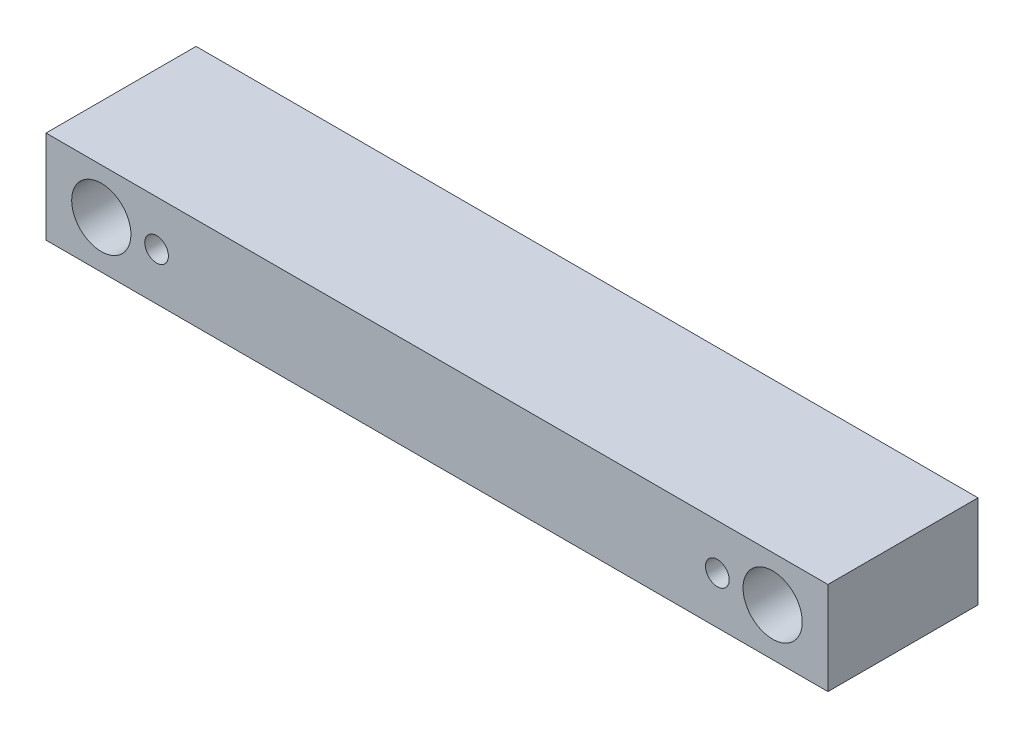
ISO-10303-21;
HEADER;
FILE_DESCRIPTION(('STEP AP214'),'2;1');
FILE_NAME('part.step','',(''),(''),'','','');
FILE_SCHEMA(('AUTOMOTIVE_DESIGN { 1 0 10303 214 1 1 1 1 }'));
ENDSEC;
DATA;
#1=APPLICATION_CONTEXT('core data for automotive mechanical design processes');
#2=APPLICATION_PROTOCOL_DEFINITION('international standard','automotive_design',2000,#1);
#3=PRODUCT_CONTEXT('',#1,'mechanical');
#4=PRODUCT('Part','Part','',(#3));
#5=PRODUCT_RELATED_PRODUCT_CATEGORY('part','',(#4));
#6=PRODUCT_DEFINITION_FORMATION('','',#4);
#7=PRODUCT_DEFINITION_CONTEXT('part definition',#1,'design');
#8=PRODUCT_DEFINITION('design','',#6,#7);
#9=PRODUCT_DEFINITION_SHAPE('','',#8);
#10=(LENGTH_UNIT() NAMED_UNIT(*) SI_UNIT(.MILLI.,.METRE.));
#11=(NAMED_UNIT(*) PLANE_ANGLE_UNIT() SI_UNIT($,.RADIAN.));
#12=(NAMED_UNIT(*) SI_UNIT($,.STERADIAN.) SOLID_ANGLE_UNIT());
#13=UNCERTAINTY_MEASURE_WITH_UNIT(LENGTH_MEASURE(1.E-05),#10,'distance_accuracy_value','');
#14=(GEOMETRIC_REPRESENTATION_CONTEXT(3) GLOBAL_UNCERTAINTY_ASSIGNED_CONTEXT((#13)) GLOBAL_UNIT_ASSIGNED_CONTEXT((#10,
#11,#12)) REPRESENTATION_CONTEXT('',''));
#15=CARTESIAN_POINT('',(0.,0.,0.));
#16=DIRECTION('',(0.,0.,1.));
#17=DIRECTION('',(1.,0.,0.));
#18=AXIS2_PLACEMENT_3D('',#15,#16,#17);
#19=CARTESIAN_POINT('',(-198.,-101.,-168.));
#20=DIRECTION('',(-1.,0.,0.));
#21=DIRECTION('',(0.,0.,1.));
#22=AXIS2_PLACEMENT_3D('',#19,#20,#21);
#23=PLANE('',#22);
#24=DIRECTION('',(0.,-1.,0.));
#25=VECTOR('',#24,1.);
#26=CARTESIAN_POINT('',(-198.,-101.,-92.));
#27=LINE('',#26,#25);
#28=CARTESIAN_POINT('',(-198.,-101.,-92.));
#29=VERTEX_POINT('',#28);
#30=CARTESIAN_POINT('',(-198.,-148.,-92.));
#31=VERTEX_POINT('',#30);
#32=EDGE_CURVE('E166',#29,#31,#27,.T.);
#33=ORIENTED_EDGE('',*,*,#32,.F.);
#34=DIRECTION('',(0.,0.,1.));
#35=VECTOR('',#34,1.);
#36=CARTESIAN_POINT('',(-198.,-101.,-168.));
#37=LINE('',#36,#35);
#38=CARTESIAN_POINT('',(-198.,-101.,-168.));
#39=VERTEX_POINT('',#38);
#40=EDGE_CURVE('E165',#39,#29,#37,.T.);
#41=ORIENTED_EDGE('',*,*,#40,.F.);
#42=DIRECTION('',(0.,-1.,0.));
#43=VECTOR('',#42,1.);
#44=CARTESIAN_POINT('',(-198.,-101.,-168.));
#45=LINE('',#44,#43);
#46=CARTESIAN_POINT('',(-198.,-148.,-168.));
#47=VERTEX_POINT('',#46);
#48=EDGE_CURVE('E150',#39,#47,#45,.T.);
#49=ORIENTED_EDGE('',*,*,#48,.T.);
#50=DIRECTION('',(0.,0.,1.));
#51=VECTOR('',#50,1.);
#52=CARTESIAN_POINT('',(-198.,-148.,-168.));
#53=LINE('',#52,#51);
#54=EDGE_CURVE('E183',#47,#31,#53,.T.);
#55=ORIENTED_EDGE('',*,*,#54,.T.);
#56=EDGE_LOOP('',(#33,#41,#49,#55));
#57=FACE_BOUND('',#56,.T.);
#58=ADVANCED_FACE('F16',(#57),#23,.T.);
#59=CARTESIAN_POINT('',(-198.,-148.,-168.));
#60=DIRECTION('',(0.,-1.,0.));
#61=DIRECTION('',(0.,0.,-1.));
#62=AXIS2_PLACEMENT_3D('',#59,#60,#61);
#63=PLANE('',#62);
#64=DIRECTION('',(1.,0.,0.));
#65=VECTOR('',#64,1.);
#66=CARTESIAN_POINT('',(-198.,-148.,-92.));
#67=LINE('',#66,#65);
#68=CARTESIAN_POINT('',(198.,-148.,-92.));
#69=VERTEX_POINT('',#68);
#70=EDGE_CURVE('E169',#31,#69,#67,.T.);
#71=ORIENTED_EDGE('',*,*,#70,.F.);
#72=ORIENTED_EDGE('',*,*,#54,.F.);
#73=DIRECTION('',(1.,0.,0.));
#74=VECTOR('',#73,1.);
#75=CARTESIAN_POINT('',(-198.,-148.,-168.));
#76=LINE('',#75,#74);
#77=CARTESIAN_POINT('',(198.,-148.,-168.));
#78=VERTEX_POINT('',#77);
#79=EDGE_CURVE('E153',#47,#78,#76,.T.);
#80=ORIENTED_EDGE('',*,*,#79,.T.);
#81=DIRECTION('',(0.,0.,1.));
#82=VECTOR('',#81,1.);
#83=CARTESIAN_POINT('',(198.,-148.,-168.));
#84=LINE('',#83,#82);
#85=EDGE_CURVE('E51',#78,#69,#84,.T.);
#86=ORIENTED_EDGE('',*,*,#85,.T.);
#87=EDGE_LOOP('',(#71,#72,#80,#86));
#88=FACE_BOUND('',#87,.T.);
#89=ADVANCED_FACE('F84',(#88),#63,.T.);
#90=CARTESIAN_POINT('',(198.,-148.,-168.));
#91=DIRECTION('',(1.,0.,0.));
#92=DIRECTION('',(0.,0.,-1.));
#93=AXIS2_PLACEMENT_3D('',#90,#91,#92);
#94=PLANE('',#93);
#95=DIRECTION('',(0.,1.,0.));
#96=VECTOR('',#95,1.);
#97=CARTESIAN_POINT('',(198.,-148.,-92.));
#98=LINE('',#97,#96);
#99=CARTESIAN_POINT('',(198.,-101.,-92.));
#100=VERTEX_POINT('',#99);
#101=EDGE_CURVE('E172',#69,#100,#98,.T.);
#102=ORIENTED_EDGE('',*,*,#101,.F.);
#103=ORIENTED_EDGE('',*,*,#85,.F.);
#104=DIRECTION('',(0.,1.,0.));
#105=VECTOR('',#104,1.);
#106=CARTESIAN_POINT('',(198.,-148.,-168.));
#107=LINE('',#106,#105);
#108=CARTESIAN_POINT('',(198.,-101.,-168.));
#109=VERTEX_POINT('',#108);
#110=EDGE_CURVE('E156',#78,#109,#107,.T.);
#111=ORIENTED_EDGE('',*,*,#110,.T.);
#112=DIRECTION('',(0.,0.,1.));
#113=VECTOR('',#112,1.);
#114=CARTESIAN_POINT('',(198.,-101.,-168.));
#115=LINE('',#114,#113);
#116=EDGE_CURVE('E33',#109,#100,#115,.T.);
#117=ORIENTED_EDGE('',*,*,#116,.T.);
#118=EDGE_LOOP('',(#102,#103,#111,#117));
#119=FACE_BOUND('',#118,.T.);
#120=ADVANCED_FACE('F90',(#119),#94,.T.);
#121=CARTESIAN_POINT('',(-170.,-124.,-168.));
#122=DIRECTION('',(0.,0.,1.));
#123=DIRECTION('',(1.,0.,0.));
#124=AXIS2_PLACEMENT_3D('',#121,#122,#123);
#125=CYLINDRICAL_SURFACE('',#124,15.);
#126=CARTESIAN_POINT('',(-170.,-124.,-168.));
#127=DIRECTION('',(0.,0.,-1.));
#128=DIRECTION('',(0.,1.,0.));
#129=AXIS2_PLACEMENT_3D('',#126,#127,#128);
#130=CIRCLE('',#129,15.);
#131=CARTESIAN_POINT('',(-170.,-109.,-168.));
#132=VERTEX_POINT('',#131);
#133=EDGE_CURVE('E159',#132,#132,#130,.T.);
#134=ORIENTED_EDGE('',*,*,#133,.T.);
#135=EDGE_LOOP('',(#134));
#136=FACE_BOUND('',#135,.T.);
#137=CARTESIAN_POINT('',(-170.,-124.,-92.));
#138=DIRECTION('',(0.,0.,-1.));
#139=DIRECTION('',(0.,1.,0.));
#140=AXIS2_PLACEMENT_3D('',#137,#138,#139);
#141=CIRCLE('',#140,15.);
#142=CARTESIAN_POINT('',(-170.,-109.,-92.));
#143=VERTEX_POINT('',#142);
#144=EDGE_CURVE('E176',#143,#143,#141,.T.);
#145=ORIENTED_EDGE('',*,*,#144,.F.);
#146=EDGE_LOOP('',(#145));
#147=FACE_BOUND('',#146,.T.);
#148=ADVANCED_FACE('F96',(#136,#147),#125,.F.);
#149=CARTESIAN_POINT('',(0.,-101.,-168.));
#150=DIRECTION('',(0.,1.,0.));
#151=DIRECTION('',(-1.,0.,0.));
#152=AXIS2_PLACEMENT_3D('',#149,#150,#151);
#153=PLANE('',#152);
#154=DIRECTION('',(-1.,0.,0.));
#155=VECTOR('',#154,1.);
#156=CARTESIAN_POINT('',(0.,-101.,-92.));
#157=LINE('',#156,#155);
#158=EDGE_CURVE('E55',#100,#29,#157,.T.);
#159=ORIENTED_EDGE('',*,*,#158,.F.);
#160=ORIENTED_EDGE('',*,*,#116,.F.);
#161=DIRECTION('',(-1.,0.,0.));
#162=VECTOR('',#161,1.);
#163=CARTESIAN_POINT('',(198.,-101.,-168.));
#164=LINE('',#163,#162);
#165=EDGE_CURVE('E58',#109,#39,#164,.T.);
#166=ORIENTED_EDGE('',*,*,#165,.T.);
#167=ORIENTED_EDGE('',*,*,#40,.T.);
#168=EDGE_LOOP('',(#159,#160,#166,#167));
#169=FACE_BOUND('',#168,.T.);
#170=ADVANCED_FACE('F98',(#169),#153,.T.);
#171=CARTESIAN_POINT('',(170.,-124.,-168.));
#172=DIRECTION('',(0.,0.,1.));
#173=DIRECTION('',(1.,0.,0.));
#174=AXIS2_PLACEMENT_3D('',#171,#172,#173);
#175=CYLINDRICAL_SURFACE('',#174,15.);
#176=CARTESIAN_POINT('',(170.,-124.,-168.));
#177=DIRECTION('',(0.,0.,-1.));
#178=DIRECTION('',(0.,1.,0.));
#179=AXIS2_PLACEMENT_3D('',#176,#177,#178);
#180=CIRCLE('',#179,15.);
#181=CARTESIAN_POINT('',(170.,-109.,-168.));
#182=VERTEX_POINT('',#181);
#183=EDGE_CURVE('E162',#182,#182,#180,.T.);
#184=ORIENTED_EDGE('',*,*,#183,.T.);
#185=EDGE_LOOP('',(#184));
#186=FACE_BOUND('',#185,.T.);
#187=CARTESIAN_POINT('',(170.,-124.,-92.));
#188=DIRECTION('',(0.,0.,-1.));
#189=DIRECTION('',(0.,1.,0.));
#190=AXIS2_PLACEMENT_3D('',#187,#188,#189);
#191=CIRCLE('',#190,15.);
#192=CARTESIAN_POINT('',(170.,-109.,-92.));
#193=VERTEX_POINT('',#192);
#194=EDGE_CURVE('E154',#193,#193,#191,.T.);
#195=ORIENTED_EDGE('',*,*,#194,.F.);
#196=EDGE_LOOP('',(#195));
#197=FACE_BOUND('',#196,.T.);
#198=ADVANCED_FACE('F101',(#186,#197),#175,.F.);
#199=CARTESIAN_POINT('',(-170.,-124.,-168.));
#200=DIRECTION('',(0.,0.,-1.));
#201=DIRECTION('',(-1.,0.,0.));
#202=AXIS2_PLACEMENT_3D('',#199,#200,#201);
#203=PLANE('',#202);
#204=CARTESIAN_POINT('',(-85.,-124.5,-168.));
#205=DIRECTION('',(0.,0.,-1.));
#206=DIRECTION('',(-1.,0.,0.));
#207=AXIS2_PLACEMENT_3D('',#204,#205,#206);
#208=CIRCLE('',#207,5.);
#209=CARTESIAN_POINT('',(-90.,-124.5,-168.));
#210=VERTEX_POINT('',#209);
#211=EDGE_CURVE('E25',#210,#210,#208,.F.);
#212=ORIENTED_EDGE('',*,*,#211,.T.);
#213=EDGE_LOOP('',(#212));
#214=FACE_BOUND('',#213,.T.);
#215=CARTESIAN_POINT('',(85.,-124.5,-168.));
#216=DIRECTION('',(0.,0.,-1.));
#217=DIRECTION('',(-1.,0.,0.));
#218=AXIS2_PLACEMENT_3D('',#215,#216,#217);
#219=CIRCLE('',#218,5.);
#220=CARTESIAN_POINT('',(80.,-124.5,-168.));
#221=VERTEX_POINT('',#220);
#222=EDGE_CURVE('E185',#221,#221,#219,.F.);
#223=ORIENTED_EDGE('',*,*,#222,.T.);
#224=EDGE_LOOP('',(#223));
#225=FACE_BOUND('',#224,.T.);
#226=CARTESIAN_POINT('',(-142.,-124.,-168.));
#227=DIRECTION('',(0.,0.,1.));
#228=DIRECTION('',(1.,0.,0.));
#229=AXIS2_PLACEMENT_3D('',#226,#227,#228);
#230=CIRCLE('',#229,6.);
#231=CARTESIAN_POINT('',(-136.,-124.,-168.));
#232=VERTEX_POINT('',#231);
#233=EDGE_CURVE('E137',#232,#232,#230,.T.);
#234=ORIENTED_EDGE('',*,*,#233,.T.);
#235=EDGE_LOOP('',(#234));
#236=FACE_BOUND('',#235,.T.);
#237=CARTESIAN_POINT('',(142.,-124.,-168.));
#238=DIRECTION('',(0.,0.,1.));
#239=DIRECTION('',(1.,0.,0.));
#240=AXIS2_PLACEMENT_3D('',#237,#238,#239);
#241=CIRCLE('',#240,6.);
#242=CARTESIAN_POINT('',(148.,-124.,-168.));
#243=VERTEX_POINT('',#242);
#244=EDGE_CURVE('E146',#243,#243,#241,.T.);
#245=ORIENTED_EDGE('',*,*,#244,.T.);
#246=EDGE_LOOP('',(#245));
#247=FACE_BOUND('',#246,.T.);
#248=ORIENTED_EDGE('',*,*,#48,.F.);
#249=ORIENTED_EDGE('',*,*,#165,.F.);
#250=ORIENTED_EDGE('',*,*,#110,.F.);
#251=ORIENTED_EDGE('',*,*,#79,.F.);
#252=EDGE_LOOP('',(#248,#249,#250,#251));
#253=FACE_BOUND('',#252,.T.);
#254=ORIENTED_EDGE('',*,*,#133,.F.);
#255=EDGE_LOOP('',(#254));
#256=FACE_BOUND('',#255,.T.);
#257=ORIENTED_EDGE('',*,*,#183,.F.);
#258=EDGE_LOOP('',(#257));
#259=FACE_BOUND('',#258,.T.);
#260=ADVANCED_FACE('F107',(#214,#225,#236,#247,#253,#256,#259),#203,.T.);
#261=CARTESIAN_POINT('',(-170.,-124.,-92.));
#262=DIRECTION('',(0.,0.,-1.));
#263=DIRECTION('',(-1.,0.,0.));
#264=AXIS2_PLACEMENT_3D('',#261,#262,#263);
#265=PLANE('',#264);
#266=CARTESIAN_POINT('',(-142.,-124.,-92.));
#267=DIRECTION('',(0.,0.,-1.));
#268=DIRECTION('',(-1.,0.,0.));
#269=AXIS2_PLACEMENT_3D('',#266,#267,#268);
#270=CIRCLE('',#269,6.);
#271=CARTESIAN_POINT('',(-148.,-124.,-92.));
#272=VERTEX_POINT('',#271);
#273=EDGE_CURVE('E141',#272,#272,#270,.T.);
#274=ORIENTED_EDGE('',*,*,#273,.T.);
#275=EDGE_LOOP('',(#274));
#276=FACE_BOUND('',#275,.T.);
#277=CARTESIAN_POINT('',(142.,-124.,-92.));
#278=DIRECTION('',(0.,0.,-1.));
#279=DIRECTION('',(-1.,0.,0.));
#280=AXIS2_PLACEMENT_3D('',#277,#278,#279);
#281=CIRCLE('',#280,6.);
#282=CARTESIAN_POINT('',(136.,-124.,-92.));
#283=VERTEX_POINT('',#282);
#284=EDGE_CURVE('E149',#283,#283,#281,.T.);
#285=ORIENTED_EDGE('',*,*,#284,.T.);
#286=EDGE_LOOP('',(#285));
#287=FACE_BOUND('',#286,.T.);
#288=ORIENTED_EDGE('',*,*,#32,.T.);
#289=ORIENTED_EDGE('',*,*,#70,.T.);
#290=ORIENTED_EDGE('',*,*,#101,.T.);
#291=ORIENTED_EDGE('',*,*,#158,.T.);
#292=EDGE_LOOP('',(#288,#289,#290,#291));
#293=FACE_BOUND('',#292,.T.);
#294=ORIENTED_EDGE('',*,*,#144,.T.);
#295=EDGE_LOOP('',(#294));
#296=FACE_BOUND('',#295,.T.);
#297=ORIENTED_EDGE('',*,*,#194,.T.);
#298=EDGE_LOOP('',(#297));
#299=FACE_BOUND('',#298,.T.);
#300=ADVANCED_FACE('F109',(#276,#287,#293,#296,#299),#265,.F.);
#301=CARTESIAN_POINT('',(142.,-124.,-168.));
#302=DIRECTION('',(0.,0.,1.));
#303=DIRECTION('',(1.,0.,0.));
#304=AXIS2_PLACEMENT_3D('',#301,#302,#303);
#305=CYLINDRICAL_SURFACE('',#304,6.);
#306=ORIENTED_EDGE('',*,*,#244,.F.);
#307=EDGE_LOOP('',(#306));
#308=FACE_BOUND('',#307,.T.);
#309=ORIENTED_EDGE('',*,*,#284,.F.);
#310=EDGE_LOOP('',(#309));
#311=FACE_BOUND('',#310,.T.);
#312=ADVANCED_FACE('F112',(#308,#311),#305,.F.);
#313=CARTESIAN_POINT('',(-142.,-124.,-168.));
#314=DIRECTION('',(0.,0.,1.));
#315=DIRECTION('',(1.,0.,0.));
#316=AXIS2_PLACEMENT_3D('',#313,#314,#315);
#317=CYLINDRICAL_SURFACE('',#316,6.);
#318=ORIENTED_EDGE('',*,*,#233,.F.);
#319=EDGE_LOOP('',(#318));
#320=FACE_BOUND('',#319,.T.);
#321=ORIENTED_EDGE('',*,*,#273,.F.);
#322=EDGE_LOOP('',(#321));
#323=FACE_BOUND('',#322,.T.);
#324=ADVANCED_FACE('F119',(#320,#323),#317,.F.);
#325=CARTESIAN_POINT('',(85.,-124.5,-147.));
#326=DIRECTION('',(0.,0.,-1.));
#327=DIRECTION('',(-1.,0.,0.));
#328=AXIS2_PLACEMENT_3D('',#325,#326,#327);
#329=CONICAL_SURFACE('',#328,4.25,1.02974425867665);
#330=CARTESIAN_POINT('',(85.,-124.5,-147.));
#331=DIRECTION('',(0.,0.,1.));
#332=DIRECTION('',(1.,0.,0.));
#333=AXIS2_PLACEMENT_3D('',#330,#331,#332);
#334=CIRCLE('',#333,4.25);
#335=CARTESIAN_POINT('',(89.25,-124.5,-147.));
#336=VERTEX_POINT('',#335);
#337=EDGE_CURVE('E135',#336,#336,#334,.T.);
#338=ORIENTED_EDGE('',*,*,#337,.F.);
#339=EDGE_LOOP('',(#338));
#340=FACE_BOUND('',#339,.T.);
#341=CARTESIAN_POINT('',(85.,-124.5,-144.446342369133));
#342=VERTEX_POINT('',#341);
#343=VERTEX_LOOP('',#342);
#344=FACE_BOUND('',#343,.T.);
#345=ADVANCED_FACE('F123',(#340,#344),#329,.F.);
#346=CARTESIAN_POINT('',(85.,-124.5,-168.));
#347=DIRECTION('',(0.,0.,1.));
#348=DIRECTION('',(1.,0.,0.));
#349=AXIS2_PLACEMENT_3D('',#346,#347,#348);
#350=CYLINDRICAL_SURFACE('',#349,4.25);
#351=CARTESIAN_POINT('',(85.,-124.5,-167.25));
#352=DIRECTION('',(0.,0.,-1.));
#353=DIRECTION('',(-1.,0.,0.));
#354=AXIS2_PLACEMENT_3D('',#351,#352,#353);
#355=CIRCLE('',#354,4.25);
#356=CARTESIAN_POINT('',(80.75,-124.5,-167.25));
#357=VERTEX_POINT('',#356);
#358=EDGE_CURVE('E193',#357,#357,#355,.T.);
#359=ORIENTED_EDGE('',*,*,#358,.T.);
#360=EDGE_LOOP('',(#359));
#361=FACE_BOUND('',#360,.T.);
#362=ORIENTED_EDGE('',*,*,#337,.T.);
#363=EDGE_LOOP('',(#362));
#364=FACE_BOUND('',#363,.T.);
#365=ADVANCED_FACE('F80',(#361,#364),#350,.F.);
#366=CARTESIAN_POINT('',(85.,-124.5,-168.));
#367=DIRECTION('',(0.,0.,-1.));
#368=DIRECTION('',(-1.,0.,0.));
#369=AXIS2_PLACEMENT_3D('',#366,#367,#368);
#370=CONICAL_SURFACE('',#369,5.,0.78539816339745);
#371=ORIENTED_EDGE('',*,*,#358,.F.);
#372=EDGE_LOOP('',(#371));
#373=FACE_BOUND('',#372,.T.);
#374=ORIENTED_EDGE('',*,*,#222,.F.);
#375=EDGE_LOOP('',(#374));
#376=FACE_BOUND('',#375,.T.);
#377=ADVANCED_FACE('F70',(#373,#376),#370,.F.);
#378=CARTESIAN_POINT('',(-85.,-124.5,-147.));
#379=DIRECTION('',(0.,0.,-1.));
#380=DIRECTION('',(-1.,0.,0.));
#381=AXIS2_PLACEMENT_3D('',#378,#379,#380);
#382=CONICAL_SURFACE('',#381,4.25,1.02974425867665);
#383=CARTESIAN_POINT('',(-85.,-124.5,-147.));
#384=DIRECTION('',(0.,0.,1.));
#385=DIRECTION('',(1.,0.,0.));
#386=AXIS2_PLACEMENT_3D('',#383,#384,#385);
#387=CIRCLE('',#386,4.25);
#388=CARTESIAN_POINT('',(-80.75,-124.5,-147.));
#389=VERTEX_POINT('',#388);
#390=EDGE_CURVE('E138',#389,#389,#387,.T.);
#391=ORIENTED_EDGE('',*,*,#390,.F.);
#392=EDGE_LOOP('',(#391));
#393=FACE_BOUND('',#392,.T.);
#394=CARTESIAN_POINT('',(-85.,-124.5,-144.446342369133));
#395=VERTEX_POINT('',#394);
#396=VERTEX_LOOP('',#395);
#397=FACE_BOUND('',#396,.T.);
#398=ADVANCED_FACE('F67',(#393,#397),#382,.F.);
#399=CARTESIAN_POINT('',(-85.,-124.5,-168.));
#400=DIRECTION('',(0.,0.,1.));
#401=DIRECTION('',(1.,0.,0.));
#402=AXIS2_PLACEMENT_3D('',#399,#400,#401);
#403=CYLINDRICAL_SURFACE('',#402,4.25);
#404=CARTESIAN_POINT('',(-85.,-124.5,-167.25));
#405=DIRECTION('',(0.,0.,-1.));
#406=DIRECTION('',(-1.,0.,0.));
#407=AXIS2_PLACEMENT_3D('',#404,#405,#406);
#408=CIRCLE('',#407,4.25);
#409=CARTESIAN_POINT('',(-89.25,-124.5,-167.25));
#410=VERTEX_POINT('',#409);
#411=EDGE_CURVE('E11',#410,#410,#408,.T.);
#412=ORIENTED_EDGE('',*,*,#411,.T.);
#413=EDGE_LOOP('',(#412));
#414=FACE_BOUND('',#413,.T.);
#415=ORIENTED_EDGE('',*,*,#390,.T.);
#416=EDGE_LOOP('',(#415));
#417=FACE_BOUND('',#416,.T.);
#418=ADVANCED_FACE('F69',(#414,#417),#403,.F.);
#419=CARTESIAN_POINT('',(-85.,-124.5,-168.));
#420=DIRECTION('',(0.,0.,-1.));
#421=DIRECTION('',(-1.,0.,0.));
#422=AXIS2_PLACEMENT_3D('',#419,#420,#421);
#423=CONICAL_SURFACE('',#422,5.,0.78539816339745);
#424=ORIENTED_EDGE('',*,*,#411,.F.);
#425=EDGE_LOOP('',(#424));
#426=FACE_BOUND('',#425,.T.);
#427=ORIENTED_EDGE('',*,*,#211,.F.);
#428=EDGE_LOOP('',(#427));
#429=FACE_BOUND('',#428,.T.);
#430=ADVANCED_FACE('F18',(#426,#429),#423,.F.);
#431=CLOSED_SHELL('',(#58,#89,#120,#148,#170,#198,#260,#300,#312,#324,#345,#365,#377,#398,#418,#430));
#432=MANIFOLD_SOLID_BREP('B1',#431);
#433=ADVANCED_BREP_SHAPE_REPRESENTATION('',(#18,#432),#14);
#434=SHAPE_DEFINITION_REPRESENTATION(#9,#433);
ENDSEC;
END-ISO-10303-21;
